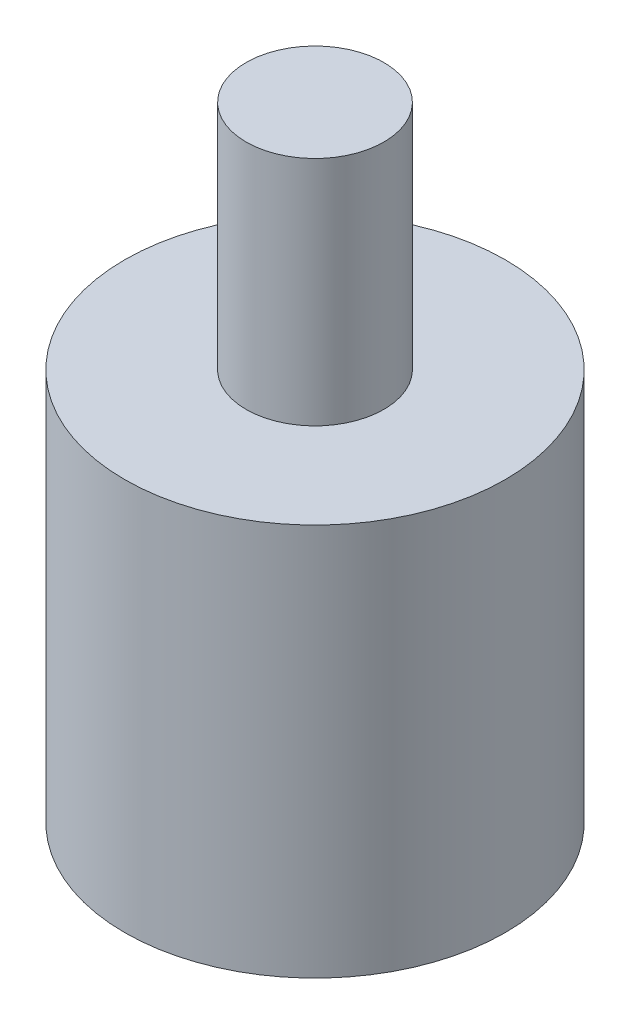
from build123d import *

# Parameters (mm, degrees)
SKETCH1_R           = 9.945
BOSS_EXTRUDE1_DEPTH = 20.5
SKETCH2_R           = 3.6
BOSS_EXTRUDE2_DEPTH = 12.1


with BuildPart() as part:
    # Sketch1 → Boss-Extrude1 (new body)
    with BuildSketch(Plane(origin=(0, 0, 0), x_dir=(1, 0, 0), z_dir=(0, 1, 0))):
        with Locations(Location((0, 0, 0), (0, 0, 270))):
            Circle(SKETCH1_R)
    extrude(amount=BOSS_EXTRUDE1_DEPTH)

    # Sketch2 → Boss-Extrude2 (add)
    with BuildSketch(Plane(origin=(0, 20.5, 0), x_dir=(1, 0, 0), z_dir=(0, 1, 0))):
        with Locations(Location((0, 0, 0), (0, 0, 270))):
            Circle(SKETCH2_R)
    extrude(amount=BOSS_EXTRUDE2_DEPTH)


solid = part.part
